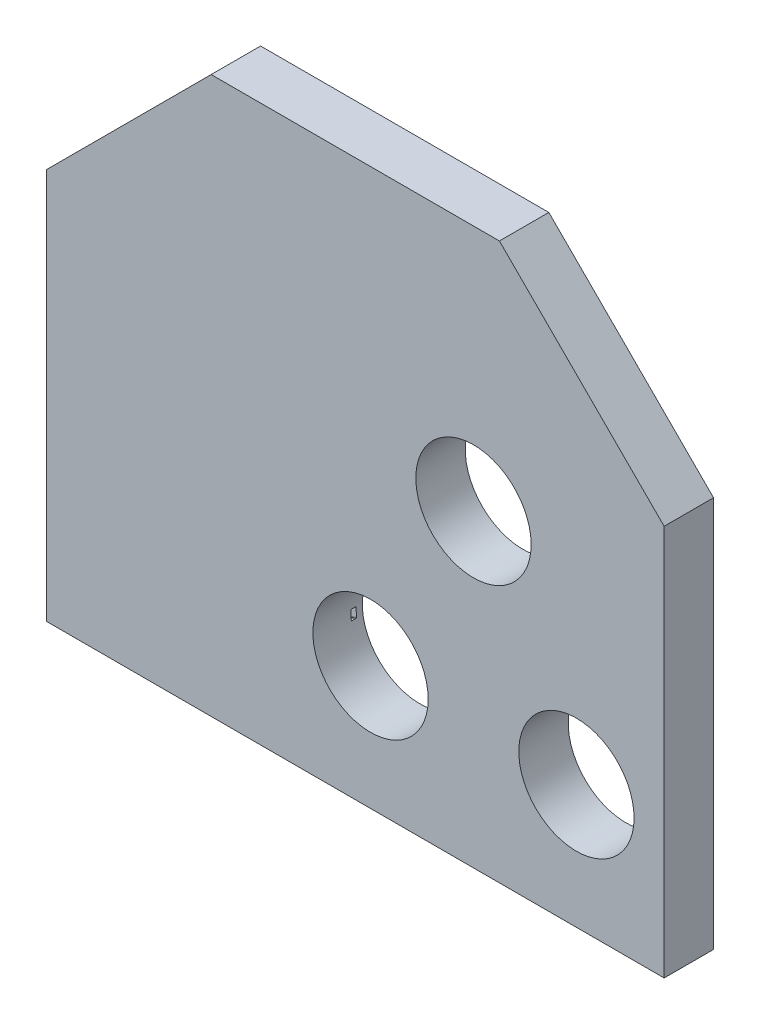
from build123d import *

# Parameters (mm, degrees)
SKIZZE1_W               = 150
SKIZZE1_H               = 135
LINEAR_AUSTRAGEN1_DEPTH = 12
SKIZZE2_R               = 14
LINEAR_AUSTRAGEN2_DEPTH = 12
FASE1_SIZE              = 40


with BuildPart() as part:
    # Skizze1 → Linear austragen1 (new body)
    with BuildSketch(Plane.XY):
        with Locations((75, 67.5)):
            Rectangle(SKIZZE1_W, SKIZZE1_H)
    extrude(amount=LINEAR_AUSTRAGEN1_DEPTH)

    # Skizze2 → Linear austragen2 (cut)
    with BuildSketch(Plane.XY.offset(12)):
        with Locations((78.7, 30)):
            Circle(SKIZZE2_R)
        with Locations((128.7, 30)):
            Circle(SKIZZE2_R)
        with Locations((103.7, 75)):
            Circle(SKIZZE2_R)
    extrude(amount=-LINEAR_AUSTRAGEN2_DEPTH, mode=Mode.SUBTRACT)

    # Skizze4 → Nut f_r DIN 472 - 28 x 1.2_ Sicherungsri (revolve, cut)
    with BuildSketch(Plane(origin=(58, 40.9, 0), x_dir=(0, -1, 0), z_dir=(-1, 0, 0))):
        with BuildLine():
            Line((14.57, 1.5), (12.6, 1.5))
            Line((12.6, 1.5), (12.6, 2.8))
            Line((12.6, 2.8), (14.57, 2.8))
            ThreePointArc((14.57, 2.8), (14.661923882, 2.761923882), (14.7, 2.67))
            Line((14.7, 2.67), (14.7, 1.63))
            ThreePointArc((14.7, 1.63), (14.661923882, 1.538076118), (14.57, 1.5))
        make_face()
    revolve(axis=Axis((58, 40.9, -50), (0, 0, 1)), mode=Mode.SUBTRACT)

    # Skizze6 → Nut f_r DIN 472 - 28 x 1.2_ Sicherun 2 (revolve, cut)
    with BuildSketch(Plane(origin=(98, 40.9, 0), x_dir=(0, -1, 0), z_dir=(-1, 0, 0))):
        with BuildLine():
            Line((14.57, 1.5), (12.6, 1.5))
            Line((12.6, 1.5), (12.6, 2.8))
            Line((12.6, 2.8), (14.57, 2.8))
            ThreePointArc((14.57, 2.8), (14.661923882, 2.761923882), (14.7, 2.67))
            Line((14.7, 2.67), (14.7, 1.63))
            ThreePointArc((14.7, 1.63), (14.661923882, 1.538076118), (14.57, 1.5))
        make_face()
    revolve(axis=Axis((98, 40.9, -50), (0, 0, 1)), mode=Mode.SUBTRACT)

    # Skizze8 → Nut f_r DIN 472 - 28 x 1.2_ Sicherun 3 (revolve, cut)
    with BuildSketch(Plane(origin=(58, 100.9, 0), x_dir=(0, -1, 0), z_dir=(-1, 0, 0)), mode=Mode.PRIVATE) as nut_f_r_din_472_28_x_1_2_sicherun_3_sk:
        with BuildLine():
            Line((14.57, 1.5), (12.6, 1.5))
            Line((12.6, 1.5), (12.6, 2.8))
            Line((12.6, 2.8), (14.57, 2.8))
            ThreePointArc((14.57, 2.8), (14.661923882, 2.761923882), (14.7, 2.67))
            Line((14.7, 2.67), (14.7, 1.63))
            ThreePointArc((14.7, 1.63), (14.661923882, 1.538076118), (14.57, 1.5))
        make_face()
    revolve(nut_f_r_din_472_28_x_1_2_sicherun_3_sk.sketch.rotate(Axis((58, 100.9, -50), (0, 0, 1)), 90), axis=Axis((58, 100.9, -50), (0, 0, 1)), mode=Mode.SUBTRACT)

    # Fase1
    fase1_edges = [part.edges().sort_by_distance(p)[0] for p in [
        (0, 135, 6),
        (150, 135, 6),
    ]]
    chamfer(fase1_edges, length=FASE1_SIZE)


solid = part.part
